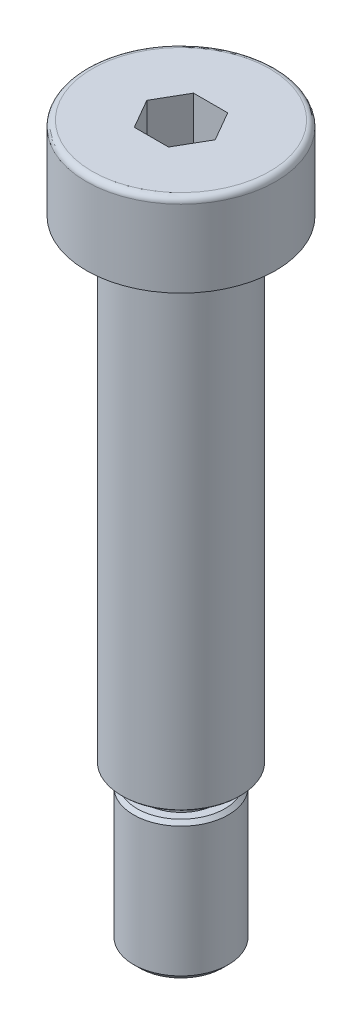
ISO-10303-21;
HEADER;
FILE_DESCRIPTION(('STEP AP214'),'2;1');
FILE_NAME('part.step','',(''),(''),'','','');
FILE_SCHEMA(('AUTOMOTIVE_DESIGN { 1 0 10303 214 1 1 1 1 }'));
ENDSEC;
DATA;
#1=APPLICATION_CONTEXT('core data for automotive mechanical design processes');
#2=APPLICATION_PROTOCOL_DEFINITION('international standard','automotive_design',2000,#1);
#3=PRODUCT_CONTEXT('',#1,'mechanical');
#4=PRODUCT('Part','Part','',(#3));
#5=PRODUCT_RELATED_PRODUCT_CATEGORY('part','',(#4));
#6=PRODUCT_DEFINITION_FORMATION('','',#4);
#7=PRODUCT_DEFINITION_CONTEXT('part definition',#1,'design');
#8=PRODUCT_DEFINITION('design','',#6,#7);
#9=PRODUCT_DEFINITION_SHAPE('','',#8);
#10=(LENGTH_UNIT() NAMED_UNIT(*) SI_UNIT(.MILLI.,.METRE.));
#11=(NAMED_UNIT(*) PLANE_ANGLE_UNIT() SI_UNIT($,.RADIAN.));
#12=(NAMED_UNIT(*) SI_UNIT($,.STERADIAN.) SOLID_ANGLE_UNIT());
#13=UNCERTAINTY_MEASURE_WITH_UNIT(LENGTH_MEASURE(1.E-05),#10,'distance_accuracy_value','');
#14=(GEOMETRIC_REPRESENTATION_CONTEXT(3) GLOBAL_UNCERTAINTY_ASSIGNED_CONTEXT((#13)) GLOBAL_UNIT_ASSIGNED_CONTEXT((#10,
#11,#12)) REPRESENTATION_CONTEXT('',''));
#15=CARTESIAN_POINT('',(0.,0.,0.));
#16=DIRECTION('',(0.,0.,1.));
#17=DIRECTION('',(1.,0.,0.));
#18=AXIS2_PLACEMENT_3D('',#15,#16,#17);
#19=CARTESIAN_POINT('',(-4.00000000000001,0.,0.));
#20=DIRECTION('',(0.,-1.,0.));
#21=DIRECTION('',(0.,0.,-1.));
#22=AXIS2_PLACEMENT_3D('',#19,#20,#21);
#23=PLANE('',#22);
#24=CARTESIAN_POINT('',(0.,0.,0.));
#25=DIRECTION('',(0.,-1.,0.));
#26=DIRECTION('',(0.,0.,-1.));
#27=AXIS2_PLACEMENT_3D('',#24,#25,#26);
#28=CIRCLE('',#27,3.5);
#29=CARTESIAN_POINT('',(0.,0.,-3.5));
#30=VERTEX_POINT('',#29);
#31=EDGE_CURVE('E178',#30,#30,#28,.T.);
#32=ORIENTED_EDGE('',*,*,#31,.T.);
#33=EDGE_LOOP('',(#32));
#34=FACE_BOUND('',#33,.T.);
#35=ADVANCED_FACE('F28',(#34),#23,.T.);
#36=CARTESIAN_POINT('',(0.,50.,0.));
#37=DIRECTION('',(0.,1.,0.));
#38=DIRECTION('',(0.,0.,1.));
#39=AXIS2_PLACEMENT_3D('',#36,#37,#38);
#40=CYLINDRICAL_SURFACE('',#39,4.);
#41=CARTESIAN_POINT('',(0.,11.45,0.));
#42=DIRECTION('',(0.,1.,0.));
#43=DIRECTION('',(0.,0.,1.));
#44=AXIS2_PLACEMENT_3D('',#41,#42,#43);
#45=CIRCLE('',#44,4.);
#46=CARTESIAN_POINT('',(0.,11.45,4.));
#47=VERTEX_POINT('',#46);
#48=EDGE_CURVE('E11',#47,#47,#45,.F.);
#49=ORIENTED_EDGE('',*,*,#48,.T.);
#50=EDGE_LOOP('',(#49));
#51=FACE_BOUND('',#50,.T.);
#52=CARTESIAN_POINT('',(0.,0.500000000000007,0.));
#53=DIRECTION('',(0.,-1.,0.));
#54=DIRECTION('',(0.,0.,-1.));
#55=AXIS2_PLACEMENT_3D('',#52,#53,#54);
#56=CIRCLE('',#55,4.);
#57=CARTESIAN_POINT('',(0.,0.500000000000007,-4.));
#58=VERTEX_POINT('',#57);
#59=EDGE_CURVE('E175',#58,#58,#56,.F.);
#60=ORIENTED_EDGE('',*,*,#59,.T.);
#61=EDGE_LOOP('',(#60));
#62=FACE_BOUND('',#61,.T.);
#63=ADVANCED_FACE('F199',(#51,#62),#40,.T.);
#64=CARTESIAN_POINT('',(-3.,11.75,0.));
#65=DIRECTION('',(0.,1.,0.));
#66=DIRECTION('',(0.,0.,1.));
#67=AXIS2_PLACEMENT_3D('',#64,#65,#66);
#68=PLANE('',#67);
#69=CARTESIAN_POINT('',(0.,11.75,0.));
#70=DIRECTION('',(0.,1.,0.));
#71=DIRECTION('',(0.,0.,1.));
#72=AXIS2_PLACEMENT_3D('',#69,#70,#71);
#73=CIRCLE('',#72,3.69999999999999);
#74=CARTESIAN_POINT('',(0.,11.75,3.69999999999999));
#75=VERTEX_POINT('',#74);
#76=EDGE_CURVE('E35',#75,#75,#73,.T.);
#77=ORIENTED_EDGE('',*,*,#76,.T.);
#78=EDGE_LOOP('',(#77));
#79=FACE_BOUND('',#78,.T.);
#80=CARTESIAN_POINT('',(0.,11.75,0.));
#81=DIRECTION('',(0.,1.,0.));
#82=DIRECTION('',(0.,0.,1.));
#83=AXIS2_PLACEMENT_3D('',#80,#81,#82);
#84=CIRCLE('',#83,3.);
#85=CARTESIAN_POINT('',(0.,11.75,3.));
#86=VERTEX_POINT('',#85);
#87=EDGE_CURVE('E148',#86,#86,#84,.T.);
#88=ORIENTED_EDGE('',*,*,#87,.F.);
#89=EDGE_LOOP('',(#88));
#90=FACE_BOUND('',#89,.T.);
#91=ADVANCED_FACE('F183',(#79,#90),#68,.T.);
#92=CARTESIAN_POINT('',(0.,50.,0.));
#93=DIRECTION('',(0.,1.,0.));
#94=DIRECTION('',(0.,0.,1.));
#95=AXIS2_PLACEMENT_3D('',#92,#93,#94);
#96=CYLINDRICAL_SURFACE('',#95,3.);
#97=CARTESIAN_POINT('',(0.,13.05,0.));
#98=DIRECTION('',(0.,-1.,0.));
#99=DIRECTION('',(0.,0.,-1.));
#100=AXIS2_PLACEMENT_3D('',#97,#98,#99);
#101=CIRCLE('',#100,3.);
#102=CARTESIAN_POINT('',(0.,13.05,-3.));
#103=VERTEX_POINT('',#102);
#104=EDGE_CURVE('E172',#103,#103,#101,.T.);
#105=ORIENTED_EDGE('',*,*,#104,.T.);
#106=EDGE_LOOP('',(#105));
#107=FACE_BOUND('',#106,.T.);
#108=ORIENTED_EDGE('',*,*,#87,.T.);
#109=EDGE_LOOP('',(#108));
#110=FACE_BOUND('',#109,.T.);
#111=ADVANCED_FACE('F212',(#107,#110),#96,.T.);
#112=CARTESIAN_POINT('',(-5.,13.25,0.));
#113=DIRECTION('',(0.,-1.,0.));
#114=DIRECTION('',(0.,0.,-1.));
#115=AXIS2_PLACEMENT_3D('',#112,#113,#114);
#116=PLANE('',#115);
#117=CARTESIAN_POINT('',(0.,13.25,0.));
#118=DIRECTION('',(0.,-1.,0.));
#119=DIRECTION('',(0.,0.,-1.));
#120=AXIS2_PLACEMENT_3D('',#117,#118,#119);
#121=CIRCLE('',#120,3.2);
#122=CARTESIAN_POINT('',(0.,13.25,-3.2));
#123=VERTEX_POINT('',#122);
#124=EDGE_CURVE('E169',#123,#123,#121,.F.);
#125=ORIENTED_EDGE('',*,*,#124,.T.);
#126=EDGE_LOOP('',(#125));
#127=FACE_BOUND('',#126,.T.);
#128=CARTESIAN_POINT('',(0.,13.25,0.));
#129=DIRECTION('',(0.,-1.,0.));
#130=DIRECTION('',(0.,0.,-1.));
#131=AXIS2_PLACEMENT_3D('',#128,#129,#130);
#132=CIRCLE('',#131,4.9);
#133=CARTESIAN_POINT('',(0.,13.25,-4.9));
#134=VERTEX_POINT('',#133);
#135=EDGE_CURVE('E166',#134,#134,#132,.T.);
#136=ORIENTED_EDGE('',*,*,#135,.T.);
#137=EDGE_LOOP('',(#136));
#138=FACE_BOUND('',#137,.T.);
#139=ADVANCED_FACE('F217',(#127,#138),#116,.T.);
#140=CARTESIAN_POINT('',(0.,50.,0.));
#141=DIRECTION('',(0.,1.,0.));
#142=DIRECTION('',(0.,0.,1.));
#143=AXIS2_PLACEMENT_3D('',#140,#141,#142);
#144=CYLINDRICAL_SURFACE('',#143,5.);
#145=CARTESIAN_POINT('',(0.,13.35,0.));
#146=DIRECTION('',(0.,-1.,0.));
#147=DIRECTION('',(0.,0.,-1.));
#148=AXIS2_PLACEMENT_3D('',#145,#146,#147);
#149=CIRCLE('',#148,5.);
#150=CARTESIAN_POINT('',(0.,13.35,-5.));
#151=VERTEX_POINT('',#150);
#152=EDGE_CURVE('E163',#151,#151,#149,.F.);
#153=ORIENTED_EDGE('',*,*,#152,.T.);
#154=EDGE_LOOP('',(#153));
#155=FACE_BOUND('',#154,.T.);
#156=CARTESIAN_POINT('',(0.,51.55,0.));
#157=DIRECTION('',(0.,1.,0.));
#158=DIRECTION('',(0.,0.,1.));
#159=AXIS2_PLACEMENT_3D('',#156,#157,#158);
#160=CIRCLE('',#159,5.);
#161=CARTESIAN_POINT('',(0.,51.55,5.));
#162=VERTEX_POINT('',#161);
#163=EDGE_CURVE('E154',#162,#162,#160,.F.);
#164=ORIENTED_EDGE('',*,*,#163,.T.);
#165=EDGE_LOOP('',(#164));
#166=FACE_BOUND('',#165,.T.);
#167=ADVANCED_FACE('F221',(#155,#166),#144,.T.);
#168=CARTESIAN_POINT('',(-4.,51.75,0.));
#169=DIRECTION('',(0.,1.,0.));
#170=DIRECTION('',(0.,0.,1.));
#171=AXIS2_PLACEMENT_3D('',#168,#169,#170);
#172=PLANE('',#171);
#173=CARTESIAN_POINT('',(0.,51.75,0.));
#174=DIRECTION('',(0.,1.,0.));
#175=DIRECTION('',(0.,0.,1.));
#176=AXIS2_PLACEMENT_3D('',#173,#174,#175);
#177=CIRCLE('',#176,4.8);
#178=CARTESIAN_POINT('',(0.,51.75,4.8));
#179=VERTEX_POINT('',#178);
#180=EDGE_CURVE('E151',#179,#179,#177,.T.);
#181=ORIENTED_EDGE('',*,*,#180,.T.);
#182=EDGE_LOOP('',(#181));
#183=FACE_BOUND('',#182,.T.);
#184=CARTESIAN_POINT('',(0.,51.75,0.));
#185=DIRECTION('',(0.,1.,0.));
#186=DIRECTION('',(0.,0.,1.));
#187=AXIS2_PLACEMENT_3D('',#184,#185,#186);
#188=CIRCLE('',#187,4.);
#189=CARTESIAN_POINT('',(0.,51.75,4.));
#190=VERTEX_POINT('',#189);
#191=EDGE_CURVE('E145',#190,#190,#188,.T.);
#192=ORIENTED_EDGE('',*,*,#191,.F.);
#193=EDGE_LOOP('',(#192));
#194=FACE_BOUND('',#193,.T.);
#195=ADVANCED_FACE('F225',(#183,#194),#172,.T.);
#196=CARTESIAN_POINT('',(0.,50.,0.));
#197=DIRECTION('',(0.,1.,0.));
#198=DIRECTION('',(0.,0.,1.));
#199=AXIS2_PLACEMENT_3D('',#196,#197,#198);
#200=CYLINDRICAL_SURFACE('',#199,4.);
#201=CARTESIAN_POINT('',(0.,53.15,0.));
#202=DIRECTION('',(0.,-1.,0.));
#203=DIRECTION('',(0.,0.,-1.));
#204=AXIS2_PLACEMENT_3D('',#201,#202,#203);
#205=CIRCLE('',#204,4.);
#206=CARTESIAN_POINT('',(0.,53.15,-4.));
#207=VERTEX_POINT('',#206);
#208=EDGE_CURVE('E160',#207,#207,#205,.T.);
#209=ORIENTED_EDGE('',*,*,#208,.T.);
#210=EDGE_LOOP('',(#209));
#211=FACE_BOUND('',#210,.T.);
#212=ORIENTED_EDGE('',*,*,#191,.T.);
#213=EDGE_LOOP('',(#212));
#214=FACE_BOUND('',#213,.T.);
#215=ADVANCED_FACE('F229',(#211,#214),#200,.T.);
#216=CARTESIAN_POINT('',(-8.,53.25,0.));
#217=DIRECTION('',(0.,-1.,0.));
#218=DIRECTION('',(0.,0.,-1.));
#219=AXIS2_PLACEMENT_3D('',#216,#217,#218);
#220=PLANE('',#219);
#221=CARTESIAN_POINT('',(0.,53.25,0.));
#222=DIRECTION('',(0.,-1.,0.));
#223=DIRECTION('',(0.,0.,-1.));
#224=AXIS2_PLACEMENT_3D('',#221,#222,#223);
#225=CIRCLE('',#224,4.1);
#226=CARTESIAN_POINT('',(0.,53.25,-4.1));
#227=VERTEX_POINT('',#226);
#228=EDGE_CURVE('E157',#227,#227,#225,.F.);
#229=ORIENTED_EDGE('',*,*,#228,.T.);
#230=EDGE_LOOP('',(#229));
#231=FACE_BOUND('',#230,.T.);
#232=CARTESIAN_POINT('',(0.,53.25,0.));
#233=DIRECTION('',(0.,1.,0.));
#234=DIRECTION('',(0.,0.,1.));
#235=AXIS2_PLACEMENT_3D('',#232,#233,#234);
#236=CIRCLE('',#235,8.);
#237=CARTESIAN_POINT('',(0.,53.25,8.));
#238=VERTEX_POINT('',#237);
#239=EDGE_CURVE('E142',#238,#238,#236,.T.);
#240=ORIENTED_EDGE('',*,*,#239,.F.);
#241=EDGE_LOOP('',(#240));
#242=FACE_BOUND('',#241,.T.);
#243=ADVANCED_FACE('F233',(#231,#242),#220,.T.);
#244=CARTESIAN_POINT('',(0.,50.,0.));
#245=DIRECTION('',(0.,1.,0.));
#246=DIRECTION('',(0.,0.,1.));
#247=AXIS2_PLACEMENT_3D('',#244,#245,#246);
#248=CYLINDRICAL_SURFACE('',#247,8.);
#249=ORIENTED_EDGE('',*,*,#239,.T.);
#250=EDGE_LOOP('',(#249));
#251=FACE_BOUND('',#250,.T.);
#252=CARTESIAN_POINT('',(0.,59.75,0.));
#253=DIRECTION('',(0.,1.,0.));
#254=DIRECTION('',(0.,0.,1.));
#255=AXIS2_PLACEMENT_3D('',#252,#253,#254);
#256=CIRCLE('',#255,8.);
#257=CARTESIAN_POINT('',(0.,59.75,8.));
#258=VERTEX_POINT('',#257);
#259=EDGE_CURVE('E139',#258,#258,#256,.T.);
#260=ORIENTED_EDGE('',*,*,#259,.F.);
#261=EDGE_LOOP('',(#260));
#262=FACE_BOUND('',#261,.T.);
#263=ADVANCED_FACE('F237',(#251,#262),#248,.T.);
#264=CARTESIAN_POINT('',(0.,59.75,0.));
#265=DIRECTION('',(0.,1.,0.));
#266=DIRECTION('',(0.,0.,1.));
#267=AXIS2_PLACEMENT_3D('',#264,#265,#266);
#268=TOROIDAL_SURFACE('',#267,7.5,0.5);
#269=CARTESIAN_POINT('',(0.,60.25,0.));
#270=DIRECTION('',(0.,1.,0.));
#271=DIRECTION('',(0.,0.,1.));
#272=AXIS2_PLACEMENT_3D('',#269,#270,#271);
#273=CIRCLE('',#272,7.5);
#274=CARTESIAN_POINT('',(0.,60.25,7.5));
#275=VERTEX_POINT('',#274);
#276=EDGE_CURVE('E130',#275,#275,#273,.T.);
#277=ORIENTED_EDGE('',*,*,#276,.F.);
#278=EDGE_LOOP('',(#277));
#279=FACE_BOUND('',#278,.T.);
#280=ORIENTED_EDGE('',*,*,#259,.T.);
#281=EDGE_LOOP('',(#280));
#282=FACE_BOUND('',#281,.T.);
#283=ADVANCED_FACE('F241',(#279,#282),#268,.T.);
#284=CARTESIAN_POINT('',(0.,60.25,0.));
#285=DIRECTION('',(0.,1.,0.));
#286=DIRECTION('',(0.,0.,1.));
#287=AXIS2_PLACEMENT_3D('',#284,#285,#286);
#288=PLANE('',#287);
#289=DIRECTION('',(-0.5,0.,0.866025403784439));
#290=VECTOR('',#289,1.);
#291=CARTESIAN_POINT('',(-1.44337567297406,60.25,-2.5));
#292=LINE('',#291,#290);
#293=CARTESIAN_POINT('',(-1.44337567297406,60.25,-2.5));
#294=VERTEX_POINT('',#293);
#295=CARTESIAN_POINT('',(-2.88675134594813,60.25,0.));
#296=VERTEX_POINT('',#295);
#297=EDGE_CURVE('E42',#294,#296,#292,.T.);
#298=ORIENTED_EDGE('',*,*,#297,.F.);
#299=DIRECTION('',(-1.,0.,0.));
#300=VECTOR('',#299,1.);
#301=CARTESIAN_POINT('',(1.44337567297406,60.25,-2.5));
#302=LINE('',#301,#300);
#303=CARTESIAN_POINT('',(1.44337567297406,60.25,-2.5));
#304=VERTEX_POINT('',#303);
#305=EDGE_CURVE('E112',#304,#294,#302,.T.);
#306=ORIENTED_EDGE('',*,*,#305,.F.);
#307=DIRECTION('',(-0.5,0.,-0.866025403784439));
#308=VECTOR('',#307,1.);
#309=CARTESIAN_POINT('',(2.88675134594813,60.25,0.));
#310=LINE('',#309,#308);
#311=CARTESIAN_POINT('',(2.88675134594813,60.25,0.));
#312=VERTEX_POINT('',#311);
#313=EDGE_CURVE('E106',#312,#304,#310,.T.);
#314=ORIENTED_EDGE('',*,*,#313,.F.);
#315=DIRECTION('',(0.5,0.,-0.866025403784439));
#316=VECTOR('',#315,1.);
#317=CARTESIAN_POINT('',(1.44337567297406,60.25,2.5));
#318=LINE('',#317,#316);
#319=CARTESIAN_POINT('',(1.44337567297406,60.25,2.5));
#320=VERTEX_POINT('',#319);
#321=EDGE_CURVE('E104',#320,#312,#318,.T.);
#322=ORIENTED_EDGE('',*,*,#321,.F.);
#323=DIRECTION('',(1.,0.,0.));
#324=VECTOR('',#323,1.);
#325=CARTESIAN_POINT('',(-1.44337567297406,60.25,2.5));
#326=LINE('',#325,#324);
#327=CARTESIAN_POINT('',(-1.44337567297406,60.25,2.5));
#328=VERTEX_POINT('',#327);
#329=EDGE_CURVE('E85',#328,#320,#326,.T.);
#330=ORIENTED_EDGE('',*,*,#329,.F.);
#331=DIRECTION('',(0.5,0.,0.866025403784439));
#332=VECTOR('',#331,1.);
#333=CARTESIAN_POINT('',(-2.88675134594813,60.25,0.));
#334=LINE('',#333,#332);
#335=EDGE_CURVE('E96',#296,#328,#334,.T.);
#336=ORIENTED_EDGE('',*,*,#335,.F.);
#337=EDGE_LOOP('',(#298,#306,#314,#322,#330,#336));
#338=FACE_BOUND('',#337,.T.);
#339=ORIENTED_EDGE('',*,*,#276,.T.);
#340=EDGE_LOOP('',(#339));
#341=FACE_BOUND('',#340,.T.);
#342=ADVANCED_FACE('F100',(#338,#341),#288,.T.);
#343=CARTESIAN_POINT('',(-1.44337567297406,55.25,-2.5));
#344=DIRECTION('',(-0.866025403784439,0.,-0.5));
#345=DIRECTION('',(-0.5,0.,0.866025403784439));
#346=AXIS2_PLACEMENT_3D('',#343,#344,#345);
#347=PLANE('',#346);
#348=ORIENTED_EDGE('',*,*,#297,.T.);
#349=DIRECTION('',(0.,1.,0.));
#350=VECTOR('',#349,1.);
#351=CARTESIAN_POINT('',(-2.88675134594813,55.25,0.));
#352=LINE('',#351,#350);
#353=CARTESIAN_POINT('',(-2.88675134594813,55.25,0.));
#354=VERTEX_POINT('',#353);
#355=EDGE_CURVE('E93',#354,#296,#352,.T.);
#356=ORIENTED_EDGE('',*,*,#355,.F.);
#357=DIRECTION('',(-0.5,0.,0.866025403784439));
#358=VECTOR('',#357,1.);
#359=CARTESIAN_POINT('',(-1.44337567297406,55.25,-2.5));
#360=LINE('',#359,#358);
#361=CARTESIAN_POINT('',(-1.44337567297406,55.25,-2.5));
#362=VERTEX_POINT('',#361);
#363=EDGE_CURVE('E114',#362,#354,#360,.T.);
#364=ORIENTED_EDGE('',*,*,#363,.F.);
#365=DIRECTION('',(0.,1.,0.));
#366=VECTOR('',#365,1.);
#367=CARTESIAN_POINT('',(-1.44337567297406,55.25,-2.5));
#368=LINE('',#367,#366);
#369=EDGE_CURVE('E49',#362,#294,#368,.T.);
#370=ORIENTED_EDGE('',*,*,#369,.T.);
#371=EDGE_LOOP('',(#348,#356,#364,#370));
#372=FACE_BOUND('',#371,.T.);
#373=ADVANCED_FACE('F248',(#372),#347,.F.);
#374=CARTESIAN_POINT('',(1.44337567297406,55.25,-2.5));
#375=DIRECTION('',(0.,0.,-1.));
#376=DIRECTION('',(-1.,0.,0.));
#377=AXIS2_PLACEMENT_3D('',#374,#375,#376);
#378=PLANE('',#377);
#379=ORIENTED_EDGE('',*,*,#305,.T.);
#380=ORIENTED_EDGE('',*,*,#369,.F.);
#381=DIRECTION('',(-1.,0.,0.));
#382=VECTOR('',#381,1.);
#383=CARTESIAN_POINT('',(1.44337567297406,55.25,-2.5));
#384=LINE('',#383,#382);
#385=CARTESIAN_POINT('',(1.44337567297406,55.25,-2.5));
#386=VERTEX_POINT('',#385);
#387=EDGE_CURVE('E126',#386,#362,#384,.T.);
#388=ORIENTED_EDGE('',*,*,#387,.F.);
#389=DIRECTION('',(0.,1.,0.));
#390=VECTOR('',#389,1.);
#391=CARTESIAN_POINT('',(1.44337567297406,55.25,-2.5));
#392=LINE('',#391,#390);
#393=EDGE_CURVE('E131',#386,#304,#392,.T.);
#394=ORIENTED_EDGE('',*,*,#393,.T.);
#395=EDGE_LOOP('',(#379,#380,#388,#394));
#396=FACE_BOUND('',#395,.T.);
#397=ADVANCED_FACE('F251',(#396),#378,.F.);
#398=CARTESIAN_POINT('',(2.88675134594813,55.25,0.));
#399=DIRECTION('',(0.866025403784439,0.,-0.5));
#400=DIRECTION('',(-0.5,0.,-0.866025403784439));
#401=AXIS2_PLACEMENT_3D('',#398,#399,#400);
#402=PLANE('',#401);
#403=ORIENTED_EDGE('',*,*,#313,.T.);
#404=ORIENTED_EDGE('',*,*,#393,.F.);
#405=DIRECTION('',(-0.5,0.,-0.866025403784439));
#406=VECTOR('',#405,1.);
#407=CARTESIAN_POINT('',(2.88675134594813,55.25,0.));
#408=LINE('',#407,#406);
#409=CARTESIAN_POINT('',(2.88675134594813,55.25,0.));
#410=VERTEX_POINT('',#409);
#411=EDGE_CURVE('E123',#410,#386,#408,.T.);
#412=ORIENTED_EDGE('',*,*,#411,.F.);
#413=DIRECTION('',(0.,1.,0.));
#414=VECTOR('',#413,1.);
#415=CARTESIAN_POINT('',(2.88675134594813,55.25,0.));
#416=LINE('',#415,#414);
#417=EDGE_CURVE('E133',#410,#312,#416,.T.);
#418=ORIENTED_EDGE('',*,*,#417,.T.);
#419=EDGE_LOOP('',(#403,#404,#412,#418));
#420=FACE_BOUND('',#419,.T.);
#421=ADVANCED_FACE('F260',(#420),#402,.F.);
#422=CARTESIAN_POINT('',(1.44337567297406,55.25,2.5));
#423=DIRECTION('',(0.866025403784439,0.,0.5));
#424=DIRECTION('',(0.5,0.,-0.866025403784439));
#425=AXIS2_PLACEMENT_3D('',#422,#423,#424);
#426=PLANE('',#425);
#427=ORIENTED_EDGE('',*,*,#321,.T.);
#428=ORIENTED_EDGE('',*,*,#417,.F.);
#429=DIRECTION('',(0.5,0.,-0.866025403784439));
#430=VECTOR('',#429,1.);
#431=CARTESIAN_POINT('',(1.44337567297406,55.25,2.5));
#432=LINE('',#431,#430);
#433=CARTESIAN_POINT('',(1.44337567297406,55.25,2.5));
#434=VERTEX_POINT('',#433);
#435=EDGE_CURVE('E120',#434,#410,#432,.T.);
#436=ORIENTED_EDGE('',*,*,#435,.F.);
#437=DIRECTION('',(0.,1.,0.));
#438=VECTOR('',#437,1.);
#439=CARTESIAN_POINT('',(1.44337567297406,55.25,2.5));
#440=LINE('',#439,#438);
#441=EDGE_CURVE('E92',#434,#320,#440,.T.);
#442=ORIENTED_EDGE('',*,*,#441,.T.);
#443=EDGE_LOOP('',(#427,#428,#436,#442));
#444=FACE_BOUND('',#443,.T.);
#445=ADVANCED_FACE('F257',(#444),#426,.F.);
#446=CARTESIAN_POINT('',(-1.44337567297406,55.25,2.5));
#447=DIRECTION('',(0.,0.,1.));
#448=DIRECTION('',(1.,0.,0.));
#449=AXIS2_PLACEMENT_3D('',#446,#447,#448);
#450=PLANE('',#449);
#451=ORIENTED_EDGE('',*,*,#329,.T.);
#452=ORIENTED_EDGE('',*,*,#441,.F.);
#453=DIRECTION('',(1.,0.,0.));
#454=VECTOR('',#453,1.);
#455=CARTESIAN_POINT('',(-1.44337567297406,55.25,2.5));
#456=LINE('',#455,#454);
#457=CARTESIAN_POINT('',(-1.44337567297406,55.25,2.5));
#458=VERTEX_POINT('',#457);
#459=EDGE_CURVE('E88',#458,#434,#456,.T.);
#460=ORIENTED_EDGE('',*,*,#459,.F.);
#461=DIRECTION('',(0.,1.,0.));
#462=VECTOR('',#461,1.);
#463=CARTESIAN_POINT('',(-1.44337567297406,55.25,2.5));
#464=LINE('',#463,#462);
#465=EDGE_CURVE('E81',#458,#328,#464,.T.);
#466=ORIENTED_EDGE('',*,*,#465,.T.);
#467=EDGE_LOOP('',(#451,#452,#460,#466));
#468=FACE_BOUND('',#467,.T.);
#469=ADVANCED_FACE('F83',(#468),#450,.F.);
#470=CARTESIAN_POINT('',(-2.88675134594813,55.25,0.));
#471=DIRECTION('',(-0.866025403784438,0.,0.5));
#472=DIRECTION('',(0.5,0.,0.866025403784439));
#473=AXIS2_PLACEMENT_3D('',#470,#471,#472);
#474=PLANE('',#473);
#475=ORIENTED_EDGE('',*,*,#335,.T.);
#476=ORIENTED_EDGE('',*,*,#465,.F.);
#477=DIRECTION('',(0.5,0.,0.866025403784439));
#478=VECTOR('',#477,1.);
#479=CARTESIAN_POINT('',(-2.88675134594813,55.25,0.));
#480=LINE('',#479,#478);
#481=EDGE_CURVE('E117',#354,#458,#480,.T.);
#482=ORIENTED_EDGE('',*,*,#481,.F.);
#483=ORIENTED_EDGE('',*,*,#355,.T.);
#484=EDGE_LOOP('',(#475,#476,#482,#483));
#485=FACE_BOUND('',#484,.T.);
#486=ADVANCED_FACE('F97',(#485),#474,.F.);
#487=CARTESIAN_POINT('',(-2.88675134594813,55.25,0.));
#488=DIRECTION('',(0.,1.,0.));
#489=DIRECTION('',(0.,0.,1.));
#490=AXIS2_PLACEMENT_3D('',#487,#488,#489);
#491=PLANE('',#490);
#492=ORIENTED_EDGE('',*,*,#363,.T.);
#493=ORIENTED_EDGE('',*,*,#481,.T.);
#494=ORIENTED_EDGE('',*,*,#459,.T.);
#495=ORIENTED_EDGE('',*,*,#435,.T.);
#496=ORIENTED_EDGE('',*,*,#411,.T.);
#497=ORIENTED_EDGE('',*,*,#387,.T.);
#498=EDGE_LOOP('',(#492,#493,#494,#495,#496,#497));
#499=FACE_BOUND('',#498,.T.);
#500=ADVANCED_FACE('F254',(#499),#491,.T.);
#501=CARTESIAN_POINT('',(0.,51.75,0.));
#502=DIRECTION('',(0.,-1.,0.));
#503=DIRECTION('',(0.,0.,-1.));
#504=AXIS2_PLACEMENT_3D('',#501,#502,#503);
#505=CONICAL_SURFACE('',#504,4.8,0.785398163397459);
#506=ORIENTED_EDGE('',*,*,#163,.F.);
#507=EDGE_LOOP('',(#506));
#508=FACE_BOUND('',#507,.T.);
#509=ORIENTED_EDGE('',*,*,#180,.F.);
#510=EDGE_LOOP('',(#509));
#511=FACE_BOUND('',#510,.T.);
#512=ADVANCED_FACE('F269',(#508,#511),#505,.T.);
#513=CARTESIAN_POINT('',(0.,53.15,0.));
#514=DIRECTION('',(0.,-1.,0.));
#515=DIRECTION('',(0.,0.,-1.));
#516=AXIS2_PLACEMENT_3D('',#513,#514,#515);
#517=TOROIDAL_SURFACE('',#516,4.1,0.1);
#518=ORIENTED_EDGE('',*,*,#208,.F.);
#519=EDGE_LOOP('',(#518));
#520=FACE_BOUND('',#519,.T.);
#521=ORIENTED_EDGE('',*,*,#228,.F.);
#522=EDGE_LOOP('',(#521));
#523=FACE_BOUND('',#522,.T.);
#524=ADVANCED_FACE('F273',(#520,#523),#517,.F.);
#525=CARTESIAN_POINT('',(0.,13.35,0.));
#526=DIRECTION('',(0.,1.,0.));
#527=DIRECTION('',(0.,0.,1.));
#528=AXIS2_PLACEMENT_3D('',#525,#526,#527);
#529=CONICAL_SURFACE('',#528,5.,0.78539816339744);
#530=ORIENTED_EDGE('',*,*,#135,.F.);
#531=EDGE_LOOP('',(#530));
#532=FACE_BOUND('',#531,.T.);
#533=ORIENTED_EDGE('',*,*,#152,.F.);
#534=EDGE_LOOP('',(#533));
#535=FACE_BOUND('',#534,.T.);
#536=ADVANCED_FACE('F277',(#532,#535),#529,.T.);
#537=CARTESIAN_POINT('',(0.,13.05,0.));
#538=DIRECTION('',(0.,-1.,0.));
#539=DIRECTION('',(0.,0.,-1.));
#540=AXIS2_PLACEMENT_3D('',#537,#538,#539);
#541=TOROIDAL_SURFACE('',#540,3.2,0.2);
#542=ORIENTED_EDGE('',*,*,#104,.F.);
#543=EDGE_LOOP('',(#542));
#544=FACE_BOUND('',#543,.T.);
#545=ORIENTED_EDGE('',*,*,#124,.F.);
#546=EDGE_LOOP('',(#545));
#547=FACE_BOUND('',#546,.T.);
#548=ADVANCED_FACE('F194',(#544,#547),#541,.F.);
#549=CARTESIAN_POINT('',(0.,0.500000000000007,0.));
#550=DIRECTION('',(0.,1.,0.));
#551=DIRECTION('',(0.,0.,1.));
#552=AXIS2_PLACEMENT_3D('',#549,#550,#551);
#553=CONICAL_SURFACE('',#552,4.,0.785398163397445);
#554=ORIENTED_EDGE('',*,*,#31,.F.);
#555=EDGE_LOOP('',(#554));
#556=FACE_BOUND('',#555,.T.);
#557=ORIENTED_EDGE('',*,*,#59,.F.);
#558=EDGE_LOOP('',(#557));
#559=FACE_BOUND('',#558,.T.);
#560=ADVANCED_FACE('F188',(#556,#559),#553,.T.);
#561=CARTESIAN_POINT('',(0.,11.75,0.));
#562=DIRECTION('',(0.,-1.,0.));
#563=DIRECTION('',(0.,0.,-1.));
#564=AXIS2_PLACEMENT_3D('',#561,#562,#563);
#565=CONICAL_SURFACE('',#564,3.69999999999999,0.785398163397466);
#566=ORIENTED_EDGE('',*,*,#48,.F.);
#567=EDGE_LOOP('',(#566));
#568=FACE_BOUND('',#567,.T.);
#569=ORIENTED_EDGE('',*,*,#76,.F.);
#570=EDGE_LOOP('',(#569));
#571=FACE_BOUND('',#570,.T.);
#572=ADVANCED_FACE('F186',(#568,#571),#565,.T.);
#573=CLOSED_SHELL('',(#35,#63,#91,#111,#139,#167,#195,#215,#243,#263,#283,#342,#373,#397,#421,
#445,#469,#486,#500,#512,#524,#536,#548,#560,#572));
#574=MANIFOLD_SOLID_BREP('B2',#573);
#575=ADVANCED_BREP_SHAPE_REPRESENTATION('',(#18,#574),#14);
#576=SHAPE_DEFINITION_REPRESENTATION(#9,#575);
ENDSEC;
END-ISO-10303-21;
